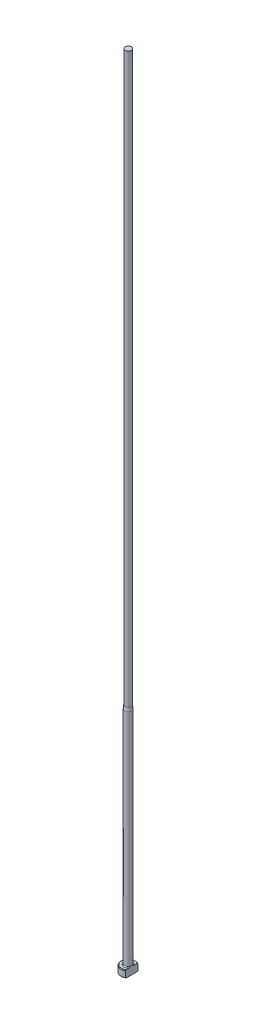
ISO-10303-21;
HEADER;
FILE_DESCRIPTION(('STEP AP214'),'2;1');
FILE_NAME('part.step','',(''),(''),'','','');
FILE_SCHEMA(('AUTOMOTIVE_DESIGN { 1 0 10303 214 1 1 1 1 }'));
ENDSEC;
DATA;
#1=APPLICATION_CONTEXT('core data for automotive mechanical design processes');
#2=APPLICATION_PROTOCOL_DEFINITION('international standard','automotive_design',2000,#1);
#3=PRODUCT_CONTEXT('',#1,'mechanical');
#4=PRODUCT('Part','Part','',(#3));
#5=PRODUCT_RELATED_PRODUCT_CATEGORY('part','',(#4));
#6=PRODUCT_DEFINITION_FORMATION('','',#4);
#7=PRODUCT_DEFINITION_CONTEXT('part definition',#1,'design');
#8=PRODUCT_DEFINITION('design','',#6,#7);
#9=PRODUCT_DEFINITION_SHAPE('','',#8);
#10=(LENGTH_UNIT() NAMED_UNIT(*) SI_UNIT(.MILLI.,.METRE.));
#11=(NAMED_UNIT(*) PLANE_ANGLE_UNIT() SI_UNIT($,.RADIAN.));
#12=(NAMED_UNIT(*) SI_UNIT($,.STERADIAN.) SOLID_ANGLE_UNIT());
#13=UNCERTAINTY_MEASURE_WITH_UNIT(LENGTH_MEASURE(1.E-05),#10,'distance_accuracy_value','');
#14=(GEOMETRIC_REPRESENTATION_CONTEXT(3) GLOBAL_UNCERTAINTY_ASSIGNED_CONTEXT((#13)) GLOBAL_UNIT_ASSIGNED_CONTEXT((#10,
#11,#12)) REPRESENTATION_CONTEXT('',''));
#15=CARTESIAN_POINT('',(0.,0.,0.));
#16=DIRECTION('',(0.,0.,1.));
#17=DIRECTION('',(1.,0.,0.));
#18=AXIS2_PLACEMENT_3D('',#15,#16,#17);
#19=CARTESIAN_POINT('',(-3.17499999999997,3.175,0.));
#20=DIRECTION('',(0.,1.,0.));
#21=DIRECTION('',(0.,0.,1.));
#22=AXIS2_PLACEMENT_3D('',#19,#20,#21);
#23=PLANE('',#22);
#24=CARTESIAN_POINT('',(0.,3.175,0.));
#25=DIRECTION('',(0.,1.,0.));
#26=DIRECTION('',(0.,0.,1.));
#27=AXIS2_PLACEMENT_3D('',#24,#25,#26);
#28=CIRCLE('',#27,2.92099999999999);
#29=CARTESIAN_POINT('',(1.58749999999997,3.175,-2.4519552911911));
#30=VERTEX_POINT('',#29);
#31=CARTESIAN_POINT('',(1.58749999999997,3.175,2.4519552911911));
#32=VERTEX_POINT('',#31);
#33=EDGE_CURVE('E105',#30,#32,#28,.T.);
#34=ORIENTED_EDGE('',*,*,#33,.T.);
#35=DIRECTION('',(0.,0.,1.));
#36=VECTOR('',#35,1.);
#37=CARTESIAN_POINT('',(1.58749999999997,3.17499999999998,2.74963065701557));
#38=LINE('',#37,#36);
#39=CARTESIAN_POINT('',(1.58749999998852,3.175,1.16397422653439));
#40=VERTEX_POINT('',#39);
#41=EDGE_CURVE('E126',#40,#32,#38,.T.);
#42=ORIENTED_EDGE('',*,*,#41,.F.);
#43=CARTESIAN_POINT('',(0.,3.175,0.));
#44=DIRECTION('',(0.,1.,0.));
#45=DIRECTION('',(0.,0.,1.));
#46=AXIS2_PLACEMENT_3D('',#43,#44,#45);
#47=CIRCLE('',#46,1.96849999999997);
#48=CARTESIAN_POINT('',(1.58749999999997,3.175,-1.16397422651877));
#49=VERTEX_POINT('',#48);
#50=EDGE_CURVE('E11',#40,#49,#47,.F.);
#51=ORIENTED_EDGE('',*,*,#50,.T.);
#52=EDGE_CURVE('E52',#30,#49,#38,.T.);
#53=ORIENTED_EDGE('',*,*,#52,.F.);
#54=EDGE_LOOP('',(#34,#42,#51,#53));
#55=FACE_BOUND('',#54,.T.);
#56=ADVANCED_FACE('F32',(#55),#23,.T.);
#57=CARTESIAN_POINT('',(0.,259.958771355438,0.));
#58=DIRECTION('',(0.,1.,0.));
#59=DIRECTION('',(0.,0.,1.));
#60=AXIS2_PLACEMENT_3D('',#57,#58,#59);
#61=CYLINDRICAL_SURFACE('',#60,3.17499999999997);
#62=CARTESIAN_POINT('',(0.,2.92100000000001,0.));
#63=DIRECTION('',(0.,1.,0.));
#64=DIRECTION('',(0.,0.,1.));
#65=AXIS2_PLACEMENT_3D('',#62,#63,#64);
#66=CIRCLE('',#65,3.17499999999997);
#67=CARTESIAN_POINT('',(1.58749999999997,2.92100000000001,2.74963065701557));
#68=VERTEX_POINT('',#67);
#69=CARTESIAN_POINT('',(1.58749999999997,2.92100000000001,-2.74963065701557));
#70=VERTEX_POINT('',#69);
#71=EDGE_CURVE('E98',#68,#70,#66,.F.);
#72=ORIENTED_EDGE('',*,*,#71,.T.);
#73=DIRECTION('',(0.,-1.,0.));
#74=VECTOR('',#73,1.);
#75=CARTESIAN_POINT('',(1.58749999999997,355.601,-2.74963065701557));
#76=LINE('',#75,#74);
#77=CARTESIAN_POINT('',(1.58749999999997,0.253999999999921,-2.74963065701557));
#78=VERTEX_POINT('',#77);
#79=EDGE_CURVE('E141',#70,#78,#76,.T.);
#80=ORIENTED_EDGE('',*,*,#79,.T.);
#81=CARTESIAN_POINT('',(0.,0.253999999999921,0.));
#82=DIRECTION('',(0.,-1.,0.));
#83=DIRECTION('',(0.,0.,-1.));
#84=AXIS2_PLACEMENT_3D('',#81,#82,#83);
#85=CIRCLE('',#84,3.17499999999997);
#86=CARTESIAN_POINT('',(1.58749999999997,0.253999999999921,2.74963065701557));
#87=VERTEX_POINT('',#86);
#88=EDGE_CURVE('E95',#78,#87,#85,.F.);
#89=ORIENTED_EDGE('',*,*,#88,.T.);
#90=DIRECTION('',(0.,-1.,0.));
#91=VECTOR('',#90,1.);
#92=CARTESIAN_POINT('',(1.58749999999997,355.601,2.74963065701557));
#93=LINE('',#92,#91);
#94=EDGE_CURVE('E88',#68,#87,#93,.T.);
#95=ORIENTED_EDGE('',*,*,#94,.F.);
#96=EDGE_LOOP('',(#72,#80,#89,#95));
#97=FACE_BOUND('',#96,.T.);
#98=ADVANCED_FACE('F191',(#97),#61,.T.);
#99=CARTESIAN_POINT('',(0.,0.,0.));
#100=DIRECTION('',(0.,-1.,0.));
#101=DIRECTION('',(0.,0.,-1.));
#102=AXIS2_PLACEMENT_3D('',#99,#100,#101);
#103=PLANE('',#102);
#104=CARTESIAN_POINT('',(0.,0.,0.));
#105=DIRECTION('',(0.,-1.,0.));
#106=DIRECTION('',(0.,0.,-1.));
#107=AXIS2_PLACEMENT_3D('',#104,#105,#106);
#108=CIRCLE('',#107,2.92100000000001);
#109=CARTESIAN_POINT('',(1.58749999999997,0.,2.45195529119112));
#110=VERTEX_POINT('',#109);
#111=CARTESIAN_POINT('',(1.58749999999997,0.,-2.45195529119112));
#112=VERTEX_POINT('',#111);
#113=EDGE_CURVE('E93',#110,#112,#108,.T.);
#114=ORIENTED_EDGE('',*,*,#113,.T.);
#115=DIRECTION('',(0.,0.,1.));
#116=VECTOR('',#115,1.);
#117=CARTESIAN_POINT('',(1.58749999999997,0.,2.74963065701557));
#118=LINE('',#117,#116);
#119=EDGE_CURVE('E78',#112,#110,#118,.T.);
#120=ORIENTED_EDGE('',*,*,#119,.T.);
#121=EDGE_LOOP('',(#114,#120));
#122=FACE_BOUND('',#121,.T.);
#123=ADVANCED_FACE('F97',(#122),#103,.T.);
#124=CARTESIAN_POINT('',(0.,3.17499999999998,0.));
#125=DIRECTION('',(0.,-1.,0.));
#126=DIRECTION('',(0.,0.,-1.));
#127=AXIS2_PLACEMENT_3D('',#124,#125,#126);
#128=CONICAL_SURFACE('',#127,2.92100000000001,0.785398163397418);
#129=ORIENTED_EDGE('',*,*,#71,.F.);
#130=CARTESIAN_POINT('',(1.58749999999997,-0.161620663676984,-6.0529050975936));
#131=CARTESIAN_POINT('',(1.58749999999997,-0.0288893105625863,-5.91567682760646));
#132=CARTESIAN_POINT('',(1.58749999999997,0.103699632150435,-5.77831035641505));
#133=CARTESIAN_POINT('',(1.58749999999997,0.368508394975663,-5.50321874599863));
#134=CARTESIAN_POINT('',(1.58749999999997,0.5007282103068,-5.3654936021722));
#135=CARTESIAN_POINT('',(1.58749999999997,0.764778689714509,-5.08953516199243));
#136=CARTESIAN_POINT('',(1.58749999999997,0.896609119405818,-4.95130164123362));
#137=CARTESIAN_POINT('',(1.58749999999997,1.15968706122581,-4.67428233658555));
#138=CARTESIAN_POINT('',(1.58749999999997,1.29093457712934,-4.5354965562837));
#139=CARTESIAN_POINT('',(1.58749999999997,1.55007705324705,-4.25997724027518));
#140=CARTESIAN_POINT('',(1.58749999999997,1.67798684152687,-4.12325766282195));
#141=CARTESIAN_POINT('',(1.58749999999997,1.9328486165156,-3.84892898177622));
#142=CARTESIAN_POINT('',(1.58749999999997,2.05980060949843,-3.71131988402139));
#143=CARTESIAN_POINT('',(1.58749999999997,2.31237508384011,-3.43493978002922));
#144=CARTESIAN_POINT('',(1.58749999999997,2.43799784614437,-3.29616903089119));
#145=CARTESIAN_POINT('',(1.58749999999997,2.68741369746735,-3.01699558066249));
#146=CARTESIAN_POINT('',(1.58749999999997,2.81120686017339,-2.8765929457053));
#147=CARTESIAN_POINT('',(1.58749999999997,3.00875865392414,-2.64816703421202));
#148=CARTESIAN_POINT('',(1.58749999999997,3.08336151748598,-2.56087478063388));
#149=CARTESIAN_POINT('',(1.58749999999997,3.23123871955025,-2.385154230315));
#150=CARTESIAN_POINT('',(1.58749999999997,3.30451292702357,-2.29672582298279));
#151=CARTESIAN_POINT('',(1.58749999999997,3.45004422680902,-2.11747400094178));
#152=CARTESIAN_POINT('',(1.58749999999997,3.52228237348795,-2.02663514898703));
#153=CARTESIAN_POINT('',(1.58749999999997,3.66423097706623,-1.84302524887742));
#154=CARTESIAN_POINT('',(1.58749999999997,3.73394203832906,-1.75025467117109));
#155=CARTESIAN_POINT('',(1.58749999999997,3.87080633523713,-1.56067475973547));
#156=CARTESIAN_POINT('',(1.58749999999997,3.93790459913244,-1.46382547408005));
#157=CARTESIAN_POINT('',(1.58749999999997,4.06669147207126,-1.26632594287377));
#158=CARTESIAN_POINT('',(1.58749999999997,4.12837264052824,-1.16567073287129));
#159=CARTESIAN_POINT('',(1.58749999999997,4.21402252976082,-1.01165766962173));
#160=CARTESIAN_POINT('',(1.58749999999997,4.2412792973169,-0.960142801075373));
#161=CARTESIAN_POINT('',(1.58749999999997,4.29309798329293,-0.85578092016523));
#162=CARTESIAN_POINT('',(1.58749999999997,4.3176594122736,-0.802933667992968));
#163=CARTESIAN_POINT('',(1.58749999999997,4.38614656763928,-0.642461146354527));
#164=CARTESIAN_POINT('',(1.58749999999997,4.42510149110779,-0.532518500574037));
#165=CARTESIAN_POINT('',(1.58749999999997,4.46726244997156,-0.367680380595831));
#166=CARTESIAN_POINT('',(1.58749999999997,4.47844427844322,-0.314802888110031));
#167=CARTESIAN_POINT('',(1.58749999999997,4.49576654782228,-0.208209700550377));
#168=CARTESIAN_POINT('',(1.58749999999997,4.50190743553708,-0.154494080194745));
#169=CARTESIAN_POINT('',(1.58749999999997,4.50871296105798,-0.0468792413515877));
#170=CARTESIAN_POINT('',(1.58749999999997,4.50939451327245,0.00701889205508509));
#171=CARTESIAN_POINT('',(1.58749999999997,4.5052767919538,0.114606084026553));
#172=CARTESIAN_POINT('',(1.58749999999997,4.5004770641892,0.16829512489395));
#173=CARTESIAN_POINT('',(1.58749999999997,4.48579689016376,0.274485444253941));
#174=CARTESIAN_POINT('',(1.58749999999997,4.47596081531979,0.326992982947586));
#175=CARTESIAN_POINT('',(1.58749999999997,4.4518180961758,0.430974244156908));
#176=CARTESIAN_POINT('',(1.58749999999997,4.43750969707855,0.482447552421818));
#177=CARTESIAN_POINT('',(1.58749999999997,4.40502489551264,0.58446088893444));
#178=CARTESIAN_POINT('',(1.58749999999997,4.38682724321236,0.634994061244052));
#179=CARTESIAN_POINT('',(1.58749999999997,4.34729308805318,0.734789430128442));
#180=CARTESIAN_POINT('',(1.58749999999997,4.32595722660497,0.784051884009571));
#181=CARTESIAN_POINT('',(1.58749999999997,4.25791922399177,0.93054934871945));
#182=CARTESIAN_POINT('',(1.58749999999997,4.20736047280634,1.02598802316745));
#183=CARTESIAN_POINT('',(1.58749999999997,4.09955451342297,1.21304313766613));
#184=CARTESIAN_POINT('',(1.58749999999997,4.04229912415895,1.30465471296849));
#185=CARTESIAN_POINT('',(1.58749999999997,3.92308746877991,1.48526211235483));
#186=CARTESIAN_POINT('',(1.58749999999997,3.86111349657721,1.57424615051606));
#187=CARTESIAN_POINT('',(1.58749999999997,3.73408621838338,1.74990003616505));
#188=CARTESIAN_POINT('',(1.58749999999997,3.66903444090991,1.83657099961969));
#189=CARTESIAN_POINT('',(1.58749999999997,3.53583371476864,2.009317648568));
#190=CARTESIAN_POINT('',(1.58749999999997,3.46765527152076,2.09537048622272));
#191=CARTESIAN_POINT('',(1.58749999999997,3.32960643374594,2.26611736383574));
#192=CARTESIAN_POINT('',(1.58749999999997,3.25973586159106,2.35081125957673));
#193=CARTESIAN_POINT('',(1.58749999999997,3.04858139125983,2.60290121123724));
#194=CARTESIAN_POINT('',(1.58749999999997,2.90542388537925,2.7687253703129));
#195=CARTESIAN_POINT('',(1.58749999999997,2.64069522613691,3.06970913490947));
#196=CARTESIAN_POINT('',(1.58749999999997,2.5195945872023,3.20528660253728));
#197=CARTESIAN_POINT('',(1.58749999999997,2.27590400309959,3.47510321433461));
#198=CARTESIAN_POINT('',(1.58749999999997,2.1533140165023,3.60934232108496));
#199=CARTESIAN_POINT('',(1.58749999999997,1.9069423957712,3.87695374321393));
#200=CARTESIAN_POINT('',(1.58749999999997,1.78315974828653,4.01032512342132));
#201=CARTESIAN_POINT('',(1.58749999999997,1.53478104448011,4.2763088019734));
#202=CARTESIAN_POINT('',(1.58749999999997,1.41018498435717,4.40892109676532));
#203=CARTESIAN_POINT('',(1.58749999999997,1.04574684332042,4.79499418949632));
#204=CARTESIAN_POINT('',(1.58749999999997,0.805076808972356,5.04767313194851));
#205=CARTESIAN_POINT('',(1.58749999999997,0.44312150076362,5.42550911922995));
#206=CARTESIAN_POINT('',(1.58749999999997,0.322378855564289,5.55118772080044));
#207=CARTESIAN_POINT('',(1.58749999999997,0.0805914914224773,5.8022520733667));
#208=CARTESIAN_POINT('',(1.58749999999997,-0.0404532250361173,5.92763782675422));
#209=CARTESIAN_POINT('',(1.58749999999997,-0.161620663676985,6.0529050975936));
#210=B_SPLINE_CURVE_WITH_KNOTS('',3,(#130,#131,#132,#133,#134,#135,#136,#137,#138,#139,#140,
#141,#142,#143,#144,#145,#146,#147,#148,#149,#150,#151,#152,#153,#154,#155,#156,#157,#158,#159,
#160,#161,#162,#163,#164,#165,#166,#167,#168,#169,#170,#171,#172,#173,#174,#175,#176,#177,#178,
#179,#180,#181,#182,#183,#184,#185,#186,#187,#188,#189,#190,#191,#192,#193,#194,#195,#196,#197,
#198,#199,#200,#201,#202,#203,#204,#205,#206,#207,#208,#209),.UNSPECIFIED.,.F.,.F.,(4,2,2,2,2,2,
2,2,2,2,2,2,2,2,2,2,2,2,2,2,2,2,2,2,2,2,2,2,2,2,2,2,2,2,2,2,2,2,2,4),(0.,0.572750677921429,
1.14550874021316,1.71856057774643,2.29160869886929,2.85328006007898,3.41494773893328,
3.97649423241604,4.53801804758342,4.88249307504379,5.2270018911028,5.57515326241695,
5.92322081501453,6.27657800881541,6.63041319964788,6.80518126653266,6.97998101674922,
7.32824262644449,7.49018491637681,7.65211285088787,7.81353889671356,7.97497832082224,
8.13501929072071,8.29512313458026,8.45612518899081,8.61709438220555,8.94062993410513,
9.26456495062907,9.58978187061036,9.91483894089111,10.2441741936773,10.5735441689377,
11.2306812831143,11.7760337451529,12.3214014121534,12.8672825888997,13.4131663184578,
14.4600164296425,14.9828595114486,15.505698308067),.UNSPECIFIED.);
#211=EDGE_CURVE('E118',#32,#68,#210,.T.);
#212=ORIENTED_EDGE('',*,*,#211,.F.);
#213=ORIENTED_EDGE('',*,*,#33,.F.);
#214=EDGE_CURVE('E117',#70,#30,#210,.T.);
#215=ORIENTED_EDGE('',*,*,#214,.F.);
#216=EDGE_LOOP('',(#129,#212,#213,#215));
#217=FACE_BOUND('',#216,.T.);
#218=ADVANCED_FACE('F162',(#217),#128,.T.);
#219=CARTESIAN_POINT('',(0.,0.253999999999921,0.));
#220=DIRECTION('',(0.,1.,0.));
#221=DIRECTION('',(0.,0.,1.));
#222=AXIS2_PLACEMENT_3D('',#219,#220,#221);
#223=CONICAL_SURFACE('',#222,3.17499999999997,0.785398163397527);
#224=ORIENTED_EDGE('',*,*,#88,.F.);
#225=CARTESIAN_POINT('',(1.58749999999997,3.33662066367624,6.0529050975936));
#226=CARTESIAN_POINT('',(1.58749999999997,3.20388931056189,5.91567682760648));
#227=CARTESIAN_POINT('',(1.58749999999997,3.07130036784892,5.7783103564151));
#228=CARTESIAN_POINT('',(1.58749999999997,2.80649160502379,5.50321874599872));
#229=CARTESIAN_POINT('',(1.58749999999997,2.6742717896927,5.36549360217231));
#230=CARTESIAN_POINT('',(1.58749999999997,2.41022131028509,5.08953516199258));
#231=CARTESIAN_POINT('',(1.58749999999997,2.27839088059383,4.95130164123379));
#232=CARTESIAN_POINT('',(1.58749999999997,2.01531293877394,4.67428233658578));
#233=CARTESIAN_POINT('',(1.58749999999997,1.88406542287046,4.53549655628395));
#234=CARTESIAN_POINT('',(1.58749999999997,1.62492294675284,4.25997724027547));
#235=CARTESIAN_POINT('',(1.58749999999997,1.49701315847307,4.12325766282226));
#236=CARTESIAN_POINT('',(1.58749999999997,1.24215138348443,3.84892898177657));
#237=CARTESIAN_POINT('',(1.58749999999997,1.11519939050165,3.71131988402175));
#238=CARTESIAN_POINT('',(1.58749999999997,0.862624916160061,3.43493978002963));
#239=CARTESIAN_POINT('',(1.58749999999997,0.737002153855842,3.29616903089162));
#240=CARTESIAN_POINT('',(1.58749999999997,0.487586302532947,3.01699558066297));
#241=CARTESIAN_POINT('',(1.58749999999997,0.363793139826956,2.8765929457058));
#242=CARTESIAN_POINT('',(1.58749999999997,0.166241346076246,2.64816703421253));
#243=CARTESIAN_POINT('',(1.58749999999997,0.0916384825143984,2.56087478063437));
#244=CARTESIAN_POINT('',(1.58749999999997,-0.0562387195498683,2.38515423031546));
#245=CARTESIAN_POINT('',(1.58749999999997,-0.129512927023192,2.29672582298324));
#246=CARTESIAN_POINT('',(1.58749999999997,-0.275044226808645,2.1174740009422));
#247=CARTESIAN_POINT('',(1.58749999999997,-0.347282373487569,2.02663514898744));
#248=CARTESIAN_POINT('',(1.58749999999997,-0.489230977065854,1.8430252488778));
#249=CARTESIAN_POINT('',(1.58749999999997,-0.558942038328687,1.75025467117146));
#250=CARTESIAN_POINT('',(1.58749999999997,-0.695806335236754,1.5606747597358));
#251=CARTESIAN_POINT('',(1.58749999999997,-0.762904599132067,1.46382547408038));
#252=CARTESIAN_POINT('',(1.58749999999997,-0.89169147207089,1.26632594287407));
#253=CARTESIAN_POINT('',(1.58749999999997,-0.953372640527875,1.16567073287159));
#254=CARTESIAN_POINT('',(1.58749999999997,-1.03902252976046,1.01165766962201));
#255=CARTESIAN_POINT('',(1.58749999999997,-1.06627929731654,0.960142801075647));
#256=CARTESIAN_POINT('',(1.58749999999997,-1.11809798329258,0.855780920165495));
#257=CARTESIAN_POINT('',(1.58749999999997,-1.14265941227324,0.802933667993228));
#258=CARTESIAN_POINT('',(1.58749999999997,-1.21114656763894,0.642461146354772));
#259=CARTESIAN_POINT('',(1.58749999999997,-1.25010149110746,0.532518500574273));
#260=CARTESIAN_POINT('',(1.58749999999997,-1.29226244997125,0.367680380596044));
#261=CARTESIAN_POINT('',(1.58749999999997,-1.30344427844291,0.314802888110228));
#262=CARTESIAN_POINT('',(1.58749999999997,-1.32076654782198,0.208209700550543));
#263=CARTESIAN_POINT('',(1.58749999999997,-1.32690743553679,0.154494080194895));
#264=CARTESIAN_POINT('',(1.58749999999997,-1.3337129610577,0.0468792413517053));
#265=CARTESIAN_POINT('',(1.58749999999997,-1.33439451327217,-0.00701889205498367));
#266=CARTESIAN_POINT('',(1.58749999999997,-1.33027679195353,-0.114606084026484));
#267=CARTESIAN_POINT('',(1.58749999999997,-1.32547706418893,-0.168295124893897));
#268=CARTESIAN_POINT('',(1.58749999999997,-1.31079689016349,-0.274485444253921));
#269=CARTESIAN_POINT('',(1.58749999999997,-1.30096081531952,-0.326992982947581));
#270=CARTESIAN_POINT('',(1.58749999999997,-1.27681809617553,-0.430974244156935));
#271=CARTESIAN_POINT('',(1.58749999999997,-1.26250969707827,-0.48244755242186));
#272=CARTESIAN_POINT('',(1.58749999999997,-1.23002489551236,-0.584460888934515));
#273=CARTESIAN_POINT('',(1.58749999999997,-1.21182724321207,-0.634994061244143));
#274=CARTESIAN_POINT('',(1.58749999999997,-1.17229308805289,-0.734789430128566));
#275=CARTESIAN_POINT('',(1.58749999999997,-1.15095722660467,-0.784051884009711));
#276=CARTESIAN_POINT('',(1.58749999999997,-1.08291922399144,-0.930549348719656));
#277=CARTESIAN_POINT('',(1.58749999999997,-1.03236047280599,-1.0259880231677));
#278=CARTESIAN_POINT('',(1.58749999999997,-0.924554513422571,-1.21304313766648));
#279=CARTESIAN_POINT('',(1.58749999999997,-0.867299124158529,-1.30465471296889));
#280=CARTESIAN_POINT('',(1.58749999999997,-0.748087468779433,-1.48526211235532));
#281=CARTESIAN_POINT('',(1.58749999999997,-0.686113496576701,-1.5742461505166));
#282=CARTESIAN_POINT('',(1.58749999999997,-0.559086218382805,-1.74990003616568));
#283=CARTESIAN_POINT('',(1.58749999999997,-0.494034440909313,-1.83657099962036));
#284=CARTESIAN_POINT('',(1.58749999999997,-0.360833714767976,-2.00931764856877));
#285=CARTESIAN_POINT('',(1.58749999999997,-0.292655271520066,-2.09537048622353));
#286=CARTESIAN_POINT('',(1.58749999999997,-0.154606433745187,-2.26611736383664));
#287=CARTESIAN_POINT('',(1.58749999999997,-0.0847358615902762,-2.35081125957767));
#288=CARTESIAN_POINT('',(1.58749999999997,0.126418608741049,-2.60290121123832));
#289=CARTESIAN_POINT('',(1.58749999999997,0.269576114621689,-2.76872537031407));
#290=CARTESIAN_POINT('',(1.58749999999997,0.534304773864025,-3.06970913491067));
#291=CARTESIAN_POINT('',(1.58749999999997,0.655405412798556,-3.20528660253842));
#292=CARTESIAN_POINT('',(1.58749999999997,0.899095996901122,-3.47510321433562));
#293=CARTESIAN_POINT('',(1.58749999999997,1.02168598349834,-3.60934232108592));
#294=CARTESIAN_POINT('',(1.58749999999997,1.26805760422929,-3.87695374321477));
#295=CARTESIAN_POINT('',(1.58749999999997,1.39184025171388,-4.0103251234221));
#296=CARTESIAN_POINT('',(1.58749999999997,1.64021895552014,-4.27630880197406));
#297=CARTESIAN_POINT('',(1.58749999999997,1.76481501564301,-4.40892109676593));
#298=CARTESIAN_POINT('',(1.58749999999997,2.12925315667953,-4.79499418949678));
#299=CARTESIAN_POINT('',(1.58749999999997,2.36992319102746,-5.04767313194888));
#300=CARTESIAN_POINT('',(1.58749999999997,2.73187849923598,-5.42550911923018));
#301=CARTESIAN_POINT('',(1.58749999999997,2.85262114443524,-5.55118772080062));
#302=CARTESIAN_POINT('',(1.58749999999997,3.09440850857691,-5.80225207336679));
#303=CARTESIAN_POINT('',(1.58749999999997,3.21545322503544,-5.92763782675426));
#304=CARTESIAN_POINT('',(1.58749999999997,3.33662066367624,-6.0529050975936));
#305=B_SPLINE_CURVE_WITH_KNOTS('',3,(#225,#226,#227,#228,#229,#230,#231,#232,#233,#234,#235,
#236,#237,#238,#239,#240,#241,#242,#243,#244,#245,#246,#247,#248,#249,#250,#251,#252,#253,#254,
#255,#256,#257,#258,#259,#260,#261,#262,#263,#264,#265,#266,#267,#268,#269,#270,#271,#272,#273,
#274,#275,#276,#277,#278,#279,#280,#281,#282,#283,#284,#285,#286,#287,#288,#289,#290,#291,#292,
#293,#294,#295,#296,#297,#298,#299,#300,#301,#302,#303,#304),.UNSPECIFIED.,.F.,.F.,(4,2,2,2,2,2,
2,2,2,2,2,2,2,2,2,2,2,2,2,2,2,2,2,2,2,2,2,2,2,2,2,2,2,2,2,2,2,2,2,4),(0.,0.572750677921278,
1.14550874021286,1.71856057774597,2.29160869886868,2.85328006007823,3.4149477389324,
3.97649423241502,4.53801804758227,4.88249307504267,5.22700189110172,5.5751532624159,
5.92322081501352,6.27657800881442,6.63041319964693,6.80518126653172,6.9799810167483,
7.3282426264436,7.49018491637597,7.65211285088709,7.81353889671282,7.97497832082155,
8.13501929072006,8.29512313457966,8.45612518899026,8.61709438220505,8.9406299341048,
9.2645649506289,9.58978187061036,9.91483894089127,10.2441741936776,10.5735441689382,
11.2306812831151,11.7760337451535,12.3214014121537,12.8672825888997,13.4131663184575,
14.4600164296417,14.9828595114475,15.5056983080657),.UNSPECIFIED.);
#306=EDGE_CURVE('E81',#112,#78,#305,.T.);
#307=ORIENTED_EDGE('',*,*,#306,.F.);
#308=ORIENTED_EDGE('',*,*,#113,.F.);
#309=EDGE_CURVE('E84',#87,#110,#305,.T.);
#310=ORIENTED_EDGE('',*,*,#309,.F.);
#311=EDGE_LOOP('',(#224,#307,#308,#310));
#312=FACE_BOUND('',#311,.T.);
#313=ADVANCED_FACE('F92',(#312),#223,.T.);
#314=CARTESIAN_POINT('',(0.,3.556,0.));
#315=DIRECTION('',(0.,1.,0.));
#316=DIRECTION('',(0.,0.,1.));
#317=AXIS2_PLACEMENT_3D('',#314,#315,#316);
#318=TOROIDAL_SURFACE('',#317,1.96849999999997,0.381);
#319=CARTESIAN_POINT('',(1.58749999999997,3.556,0.));
#320=CARTESIAN_POINT('',(1.58749999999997,3.55599928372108,-9.72839998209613E-12));
#321=CARTESIAN_POINT('',(1.58749999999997,3.55599856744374,-1.16390048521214E-07));
#322=CARTESIAN_POINT('',(1.58749999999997,3.55599717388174,-5.02802253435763E-07));
#323=CARTESIAN_POINT('',(1.58749999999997,3.55599649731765,-7.75049116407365E-07));
#324=CARTESIAN_POINT('',(1.58749999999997,3.55599515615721,-1.43578185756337E-06));
#325=CARTESIAN_POINT('',(1.58749999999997,3.55599449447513,-1.83004116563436E-06));
#326=CARTESIAN_POINT('',(1.58749999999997,3.55599322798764,-2.69326525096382E-06));
#327=CARTESIAN_POINT('',(1.58749999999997,3.55599262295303,-3.16190628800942E-06));
#328=CARTESIAN_POINT('',(1.58749999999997,3.55599066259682,-4.80183833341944E-06));
#329=CARTESIAN_POINT('',(1.58749999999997,3.55598938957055,-6.07237548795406E-06));
#330=CARTESIAN_POINT('',(1.58749999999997,3.55598706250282,-8.74131694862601E-06));
#331=CARTESIAN_POINT('',(1.58749999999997,3.55598600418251,-1.01362054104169E-05));
#332=CARTESIAN_POINT('',(1.58749999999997,3.55598220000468,-1.54025644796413E-05));
#333=CARTESIAN_POINT('',(1.58749999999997,3.55597966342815,-1.94297992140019E-05));
#334=CARTESIAN_POINT('',(1.58749999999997,3.55597535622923,-2.75116574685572E-05));
#335=CARTESIAN_POINT('',(1.58749999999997,3.55597354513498,-3.15456374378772E-05));
#336=CARTESIAN_POINT('',(1.58749999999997,3.55596616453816,-4.82039076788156E-05));
#337=CARTESIAN_POINT('',(1.58749999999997,3.55596077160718,-6.08993138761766E-05));
#338=CARTESIAN_POINT('',(1.58749999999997,3.55595181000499,-8.49758225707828E-05));
#339=CARTESIAN_POINT('',(1.58749999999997,3.55594809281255,-9.6299831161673E-05));
#340=CARTESIAN_POINT('',(1.58749999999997,3.55591954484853,-0.000176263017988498));
#341=CARTESIAN_POINT('',(1.58749999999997,3.55588430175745,-0.000240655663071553));
#342=CARTESIAN_POINT('',(1.58749999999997,3.55575419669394,-0.000487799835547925));
#343=CARTESIAN_POINT('',(1.58749999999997,3.55566706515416,-0.000673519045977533));
#344=CARTESIAN_POINT('',(1.58749999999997,3.55532896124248,-0.00138308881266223));
#345=CARTESIAN_POINT('',(1.58749999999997,3.55506990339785,-0.0019038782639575));
#346=CARTESIAN_POINT('',(1.58749999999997,3.55403272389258,-0.00399959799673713));
#347=CARTESIAN_POINT('',(1.58749999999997,3.55326363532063,-0.0055779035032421));
#348=CARTESIAN_POINT('',(1.58749999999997,3.53734419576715,-0.0382341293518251));
#349=CARTESIAN_POINT('',(1.58749999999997,3.52209124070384,-0.0692744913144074));
#350=CARTESIAN_POINT('',(1.58749999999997,3.49234031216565,-0.130397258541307));
#351=CARTESIAN_POINT('',(1.58749999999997,3.4778343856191,-0.160476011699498));
#352=CARTESIAN_POINT('',(1.58749999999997,3.44756579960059,-0.22405302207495));
#353=CARTESIAN_POINT('',(1.58749999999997,3.43183768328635,-0.257567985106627));
#354=CARTESIAN_POINT('',(1.58749999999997,3.40084315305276,-0.325196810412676));
#355=CARTESIAN_POINT('',(1.58749999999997,3.38558252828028,-0.359313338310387));
#356=CARTESIAN_POINT('',(1.58749999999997,3.35947844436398,-0.419670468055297));
#357=CARTESIAN_POINT('',(1.58749999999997,3.34845502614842,-0.445832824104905));
#358=CARTESIAN_POINT('',(1.58749999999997,3.32703860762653,-0.498343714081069));
#359=CARTESIAN_POINT('',(1.58749999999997,3.31664422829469,-0.52469168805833));
#360=CARTESIAN_POINT('',(1.58749999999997,3.2869407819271,-0.603098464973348));
#361=CARTESIAN_POINT('',(1.58749999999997,3.26865317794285,-0.655557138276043));
#362=CARTESIAN_POINT('',(1.58749999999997,3.24332469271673,-0.737608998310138));
#363=CARTESIAN_POINT('',(1.58749999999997,3.23494346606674,-0.766787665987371));
#364=CARTESIAN_POINT('',(1.58749999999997,3.21949479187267,-0.825628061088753));
#365=CARTESIAN_POINT('',(1.58749999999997,3.21243348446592,-0.855291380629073));
#366=CARTESIAN_POINT('',(1.58749999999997,3.19303275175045,-0.947623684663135));
#367=CARTESIAN_POINT('',(1.58749999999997,3.18336484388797,-1.01091582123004));
#368=CARTESIAN_POINT('',(1.58749999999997,3.17464826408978,-1.12491727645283));
#369=CARTESIAN_POINT('',(1.58749999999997,3.17379742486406,-1.17548103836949));
#370=CARTESIAN_POINT('',(1.58749999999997,3.17980825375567,-1.2756075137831));
#371=CARTESIAN_POINT('',(1.58749999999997,3.18656467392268,-1.32517446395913));
#372=CARTESIAN_POINT('',(1.58749999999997,3.20510062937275,-1.40268723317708));
#373=CARTESIAN_POINT('',(1.58749999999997,3.21379930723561,-1.43136704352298));
#374=CARTESIAN_POINT('',(1.58749999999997,3.23523847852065,-1.48727388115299));
#375=CARTESIAN_POINT('',(1.58749999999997,3.24798385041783,-1.51449910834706));
#376=CARTESIAN_POINT('',(1.58749999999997,3.27479889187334,-1.56082978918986));
#377=CARTESIAN_POINT('',(1.58749999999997,3.2880084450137,-1.5804296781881));
#378=CARTESIAN_POINT('',(1.58749999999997,3.31738741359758,-1.61726850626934));
#379=CARTESIAN_POINT('',(1.58749999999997,3.33355126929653,-1.63451177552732));
#380=CARTESIAN_POINT('',(1.58749999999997,3.3650209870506,-1.66235366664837));
#381=CARTESIAN_POINT('',(1.58749999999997,3.37976591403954,-1.67358404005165));
#382=CARTESIAN_POINT('',(1.58749999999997,3.41090649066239,-1.69348690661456));
#383=CARTESIAN_POINT('',(1.58749999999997,3.42730148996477,-1.70216040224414));
#384=CARTESIAN_POINT('',(1.58749999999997,3.46152587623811,-1.71647536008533));
#385=CARTESIAN_POINT('',(1.58749999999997,3.47936500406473,-1.72209384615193));
#386=CARTESIAN_POINT('',(1.58749999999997,3.51579449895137,-1.72977101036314));
#387=CARTESIAN_POINT('',(1.58749999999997,3.53438431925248,-1.73183223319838));
#388=CARTESIAN_POINT('',(1.58749999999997,3.5693049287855,-1.73220894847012));
#389=CARTESIAN_POINT('',(1.58749999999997,3.58563247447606,-1.73095378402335));
#390=CARTESIAN_POINT('',(1.58749999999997,3.61782719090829,-1.72566824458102));
#391=CARTESIAN_POINT('',(1.58749999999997,3.6336944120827,-1.72163817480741));
#392=CARTESIAN_POINT('',(1.58749999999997,3.66430913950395,-1.71112762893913));
#393=CARTESIAN_POINT('',(1.58749999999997,3.67907021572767,-1.70468621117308));
#394=CARTESIAN_POINT('',(1.58749999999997,3.7074589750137,-1.68967506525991));
#395=CARTESIAN_POINT('',(1.58749999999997,3.72108625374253,-1.68110458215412));
#396=CARTESIAN_POINT('',(1.58749999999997,3.75190835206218,-1.6586320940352));
#397=CARTESIAN_POINT('',(1.58749999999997,3.76852524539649,-1.64393589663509));
#398=CARTESIAN_POINT('',(1.58749999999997,3.79915076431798,-1.61203006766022));
#399=CARTESIAN_POINT('',(1.58749999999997,3.81315342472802,-1.59481484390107));
#400=CARTESIAN_POINT('',(1.58749999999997,3.84335302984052,-1.55180967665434));
#401=CARTESIAN_POINT('',(1.58749999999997,3.85840997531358,-1.52522183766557));
#402=CARTESIAN_POINT('',(1.58749999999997,3.8840928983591,-1.47008223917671));
#403=CARTESIAN_POINT('',(1.58749999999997,3.89472145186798,-1.44153163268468));
#404=CARTESIAN_POINT('',(1.58749999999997,3.91656912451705,-1.36850699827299));
#405=CARTESIAN_POINT('',(1.58749999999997,3.92534811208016,-1.32330828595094));
#406=CARTESIAN_POINT('',(1.58749999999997,3.93598980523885,-1.23163561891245));
#407=CARTESIAN_POINT('',(1.58749999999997,3.93776012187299,-1.18515271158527));
#408=CARTESIAN_POINT('',(1.58749999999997,3.93485724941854,-1.056626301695));
#409=CARTESIAN_POINT('',(1.58749999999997,3.9241811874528,-0.974728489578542));
#410=CARTESIAN_POINT('',(1.58749999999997,3.899893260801,-0.855941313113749));
#411=CARTESIAN_POINT('',(1.58749999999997,3.89075037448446,-0.817952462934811));
#412=CARTESIAN_POINT('',(1.58749999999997,3.87034922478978,-0.742758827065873));
#413=CARTESIAN_POINT('',(1.58749999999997,3.85910312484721,-0.705550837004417));
#414=CARTESIAN_POINT('',(1.58749999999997,3.83067738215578,-0.618900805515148));
#415=CARTESIAN_POINT('',(1.58749999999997,3.81279292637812,-0.56969368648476));
#416=CARTESIAN_POINT('',(1.58749999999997,3.78404415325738,-0.496059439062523));
#417=CARTESIAN_POINT('',(1.58749999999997,3.77402894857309,-0.471293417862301));
#418=CARTESIAN_POINT('',(1.58749999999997,3.75347166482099,-0.421913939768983));
#419=CARTESIAN_POINT('',(1.58749999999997,3.74292842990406,-0.39730096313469));
#420=CARTESIAN_POINT('',(1.58749999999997,3.71797467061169,-0.340371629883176));
#421=CARTESIAN_POINT('',(1.58749999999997,3.7034106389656,-0.308122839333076));
#422=CARTESIAN_POINT('',(1.58749999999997,3.67389634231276,-0.244169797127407));
#423=CARTESIAN_POINT('',(1.58749999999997,3.65895097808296,-0.212463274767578));
#424=CARTESIAN_POINT('',(1.58749999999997,3.63022587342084,-0.152300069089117));
#425=CARTESIAN_POINT('',(1.58749999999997,3.61647532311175,-0.123829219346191));
#426=CARTESIAN_POINT('',(1.58749999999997,3.58829058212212,-0.065967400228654));
#427=CARTESIAN_POINT('',(1.58749999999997,3.57384944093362,-0.036579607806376));
#428=CARTESIAN_POINT('',(1.58749999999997,3.55873641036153,-0.00557801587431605));
#429=CARTESIAN_POINT('',(1.58749999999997,3.557967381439,-0.00399981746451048));
#430=CARTESIAN_POINT('',(1.58749999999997,3.55693021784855,-0.00190412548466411));
#431=CARTESIAN_POINT('',(1.58749999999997,3.55667111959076,-0.00138325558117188));
#432=CARTESIAN_POINT('',(1.58749999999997,3.55633296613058,-0.00067358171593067));
#433=CARTESIAN_POINT('',(1.58749999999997,3.55624582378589,-0.000487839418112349));
#434=CARTESIAN_POINT('',(1.58749999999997,3.55611570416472,-0.000240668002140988));
#435=CARTESIAN_POINT('',(1.58749999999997,3.55608045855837,-0.000176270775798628));
#436=CARTESIAN_POINT('',(1.58749999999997,3.55605190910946,-9.63021903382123E-05));
#437=CARTESIAN_POINT('',(1.58749999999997,3.55604819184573,-8.49777827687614E-05));
#438=CARTESIAN_POINT('',(1.58749999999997,3.55603922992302,-6.09004217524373E-05));
#439=CARTESIAN_POINT('',(1.58749999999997,3.55603383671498,-4.82045726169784E-05));
#440=CARTESIAN_POINT('',(1.58749999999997,3.55602645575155,-3.15458034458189E-05));
#441=CARTESIAN_POINT('',(1.58749999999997,3.55602464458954,-2.75117552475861E-05));
#442=CARTESIAN_POINT('',(1.58749999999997,3.55602033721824,-1.94297725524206E-05));
#443=CARTESIAN_POINT('',(1.58749999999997,3.55601780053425,-1.54024835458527E-05));
#444=CARTESIAN_POINT('',(1.58749999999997,3.55601399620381,-1.01360754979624E-05));
#445=CARTESIAN_POINT('',(1.58749999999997,3.55601293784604,-8.7411813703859E-06));
#446=CARTESIAN_POINT('',(1.58749999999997,3.55601061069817,-6.07223627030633E-06));
#447=CARTESIAN_POINT('',(1.58749999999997,3.55600933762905,-4.80170138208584E-06));
#448=CARTESIAN_POINT('',(1.58749999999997,3.55600737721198,-3.16178168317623E-06));
#449=CARTESIAN_POINT('',(1.58749999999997,3.55600677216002,-2.69314602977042E-06));
#450=CARTESIAN_POINT('',(1.58749999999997,3.55600550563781,-1.82993577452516E-06));
#451=CARTESIAN_POINT('',(1.58749999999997,3.55600484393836,-1.43568493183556E-06));
#452=CARTESIAN_POINT('',(1.58749999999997,3.55600350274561,-7.74972790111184E-07));
#453=CARTESIAN_POINT('',(1.58749999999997,3.55600282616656,-5.02737772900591E-07));
#454=CARTESIAN_POINT('',(1.58749999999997,3.55600143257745,-1.16354060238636E-07));
#455=CARTESIAN_POINT('',(1.58749999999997,3.55600071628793,9.72852226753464E-12));
#456=CARTESIAN_POINT('',(1.58749999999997,3.556,0.));
#457=B_SPLINE_CURVE_WITH_KNOTS('',3,(#319,#320,#321,#322,#323,#324,#325,#326,#327,#328,#329,
#330,#331,#332,#333,#334,#335,#336,#337,#338,#339,#340,#341,#342,#343,#344,#345,#346,#347,#348,
#349,#350,#351,#352,#353,#354,#355,#356,#357,#358,#359,#360,#361,#362,#363,#364,#365,#366,#367,
#368,#369,#370,#371,#372,#373,#374,#375,#376,#377,#378,#379,#380,#381,#382,#383,#384,#385,#386,
#387,#388,#389,#390,#391,#392,#393,#394,#395,#396,#397,#398,#399,#400,#401,#402,#403,#404,#405,
#406,#407,#408,#409,#410,#411,#412,#413,#414,#415,#416,#417,#418,#419,#420,#421,#422,#423,#424,
#425,#426,#427,#428,#429,#430,#431,#432,#433,#434,#435,#436,#437,#438,#439,#440,#441,#442,#443,
#444,#445,#446,#447,#448,#449,#450,#451,#452,#453,#454,#455,#456),.UNSPECIFIED.,.T.,.F.,(4,2,2,
2,2,2,2,2,2,2,2,2,2,2,2,2,2,2,2,2,2,2,2,2,2,2,2,2,2,2,2,2,2,2,2,2,2,2,2,2,2,2,2,2,2,2,2,2,2,2,2,
2,2,2,2,2,2,2,2,2,2,2,2,2,2,2,2,2,4),(0.,2.14653634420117E-06,4.3243617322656E-06,
6.62715069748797E-06,8.92017875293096E-06,1.42892293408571E-05,1.95376032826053E-05,
3.37616071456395E-05,4.70144492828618E-05,8.83789092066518E-05,0.000124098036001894,
0.000343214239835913,0.000959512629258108,0.00270343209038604,0.00797166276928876,
0.11171345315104,0.21189766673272,0.322958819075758,0.435072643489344,0.520234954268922,
0.605203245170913,0.771741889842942,0.862787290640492,0.954246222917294,1.14571222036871,
1.29701464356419,1.44624921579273,1.53592478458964,1.62570887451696,1.69637166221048,
1.76690281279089,1.82229027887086,1.87765600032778,1.93343255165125,1.98916918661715,
2.03805361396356,2.08693266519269,2.13505202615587,2.18318847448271,2.24937187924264,
2.31570450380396,2.4068617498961,2.49796589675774,2.63532677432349,2.77449244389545,
3.02069049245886,3.13789423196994,3.25444001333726,3.41142684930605,3.491566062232,
3.57188909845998,3.67803747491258,3.78319074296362,3.87804579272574,3.97626481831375,
3.98153268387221,3.98327687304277,3.98389324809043,3.98411237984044,3.98414810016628,
3.98418946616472,3.98420271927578,3.98421694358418,3.98422219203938,3.9842275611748,
3.98422985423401,3.98423215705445,3.98423433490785,3.98423648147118),.UNSPECIFIED.);
#458=CARTESIAN_POINT('',(1.58749999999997,3.556,0.));
#459=VERTEX_POINT('',#458);
#460=EDGE_CURVE('E47',#459,#49,#457,.T.);
#461=ORIENTED_EDGE('',*,*,#460,.T.);
#462=ORIENTED_EDGE('',*,*,#50,.F.);
#463=CARTESIAN_POINT('',(1.58749999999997,3.556,0.));
#464=CARTESIAN_POINT('',(1.58749999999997,3.55600071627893,9.72842792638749E-12));
#465=CARTESIAN_POINT('',(1.58749999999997,3.55600143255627,1.16390048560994E-07));
#466=CARTESIAN_POINT('',(1.58749999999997,3.55600282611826,5.02802253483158E-07));
#467=CARTESIAN_POINT('',(1.58749999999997,3.55600350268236,7.7504911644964E-07));
#468=CARTESIAN_POINT('',(1.58749999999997,3.5560048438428,1.43578185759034E-06));
#469=CARTESIAN_POINT('',(1.58749999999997,3.55600550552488,1.83004116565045E-06));
#470=CARTESIAN_POINT('',(1.58749999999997,3.55600677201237,2.69326525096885E-06));
#471=CARTESIAN_POINT('',(1.58749999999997,3.55600737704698,3.16190628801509E-06));
#472=CARTESIAN_POINT('',(1.58749999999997,3.55600933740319,4.80183833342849E-06));
#473=CARTESIAN_POINT('',(1.58749999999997,3.55601061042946,6.07237548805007E-06));
#474=CARTESIAN_POINT('',(1.58749999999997,3.55601293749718,8.74131694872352E-06));
#475=CARTESIAN_POINT('',(1.58749999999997,3.55601399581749,1.01362054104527E-05));
#476=CARTESIAN_POINT('',(1.58749999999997,3.55601779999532,1.54025644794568E-05));
#477=CARTESIAN_POINT('',(1.58749999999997,3.55602033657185,1.94297992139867E-05));
#478=CARTESIAN_POINT('',(1.58749999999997,3.55602464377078,2.75116574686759E-05));
#479=CARTESIAN_POINT('',(1.58749999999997,3.55602645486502,3.15456374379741E-05));
#480=CARTESIAN_POINT('',(1.58749999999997,3.55603383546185,4.8203907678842E-05));
#481=CARTESIAN_POINT('',(1.58749999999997,3.55603922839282,6.0899313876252E-05));
#482=CARTESIAN_POINT('',(1.58749999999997,3.55604818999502,8.49758225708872E-05));
#483=CARTESIAN_POINT('',(1.58749999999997,3.55605190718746,9.62998311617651E-05));
#484=CARTESIAN_POINT('',(1.58749999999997,3.55608045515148,0.000176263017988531));
#485=CARTESIAN_POINT('',(1.58749999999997,3.55611569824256,0.000240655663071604));
#486=CARTESIAN_POINT('',(1.58749999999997,3.55624580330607,0.000487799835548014));
#487=CARTESIAN_POINT('',(1.58749999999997,3.55633293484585,0.000673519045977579));
#488=CARTESIAN_POINT('',(1.58749999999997,3.55667103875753,0.00138308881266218));
#489=CARTESIAN_POINT('',(1.58749999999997,3.55693009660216,0.00190387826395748));
#490=CARTESIAN_POINT('',(1.58749999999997,3.55796727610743,0.00399959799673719));
#491=CARTESIAN_POINT('',(1.58749999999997,3.55873636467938,0.00557790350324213));
#492=CARTESIAN_POINT('',(1.58749999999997,3.57465580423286,0.038234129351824));
#493=CARTESIAN_POINT('',(1.58749999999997,3.58990875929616,0.0692744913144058));
#494=CARTESIAN_POINT('',(1.58749999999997,3.61965968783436,0.130397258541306));
#495=CARTESIAN_POINT('',(1.58749999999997,3.63416561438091,0.160476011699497));
#496=CARTESIAN_POINT('',(1.58749999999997,3.66443420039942,0.22405302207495));
#497=CARTESIAN_POINT('',(1.58749999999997,3.68016231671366,0.257567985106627));
#498=CARTESIAN_POINT('',(1.58749999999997,3.71115684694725,0.325196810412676));
#499=CARTESIAN_POINT('',(1.58749999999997,3.72641747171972,0.359313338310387));
#500=CARTESIAN_POINT('',(1.58749999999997,3.75252155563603,0.419670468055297));
#501=CARTESIAN_POINT('',(1.58749999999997,3.76354497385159,0.445832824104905));
#502=CARTESIAN_POINT('',(1.58749999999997,3.78496139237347,0.498343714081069));
#503=CARTESIAN_POINT('',(1.58749999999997,3.79535577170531,0.524691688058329));
#504=CARTESIAN_POINT('',(1.58749999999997,3.82505921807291,0.603098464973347));
#505=CARTESIAN_POINT('',(1.58749999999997,3.84334682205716,0.655557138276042));
#506=CARTESIAN_POINT('',(1.58749999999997,3.86867530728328,0.737608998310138));
#507=CARTESIAN_POINT('',(1.58749999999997,3.87705653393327,0.766787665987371));
#508=CARTESIAN_POINT('',(1.58749999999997,3.89250520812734,0.825628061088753));
#509=CARTESIAN_POINT('',(1.58749999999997,3.89956651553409,0.855291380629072));
#510=CARTESIAN_POINT('',(1.58749999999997,3.91896724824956,0.947623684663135));
#511=CARTESIAN_POINT('',(1.58749999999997,3.92863515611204,1.01091582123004));
#512=CARTESIAN_POINT('',(1.58749999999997,3.93735173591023,1.12491727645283));
#513=CARTESIAN_POINT('',(1.58749999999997,3.93820257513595,1.17548103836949));
#514=CARTESIAN_POINT('',(1.58749999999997,3.93219174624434,1.2756075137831));
#515=CARTESIAN_POINT('',(1.58749999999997,3.92543532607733,1.32517446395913));
#516=CARTESIAN_POINT('',(1.58749999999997,3.90689937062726,1.40268723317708));
#517=CARTESIAN_POINT('',(1.58749999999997,3.8982006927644,1.43136704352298));
#518=CARTESIAN_POINT('',(1.58749999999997,3.87676152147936,1.48727388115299));
#519=CARTESIAN_POINT('',(1.58749999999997,3.86401614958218,1.51449910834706));
#520=CARTESIAN_POINT('',(1.58749999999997,3.83720110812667,1.56082978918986));
#521=CARTESIAN_POINT('',(1.58749999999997,3.82399155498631,1.5804296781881));
#522=CARTESIAN_POINT('',(1.58749999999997,3.79461258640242,1.61726850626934));
#523=CARTESIAN_POINT('',(1.58749999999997,3.77844873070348,1.63451177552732));
#524=CARTESIAN_POINT('',(1.58749999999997,3.74697901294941,1.66235366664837));
#525=CARTESIAN_POINT('',(1.58749999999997,3.73223408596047,1.67358404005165));
#526=CARTESIAN_POINT('',(1.58749999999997,3.70109350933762,1.69348690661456));
#527=CARTESIAN_POINT('',(1.58749999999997,3.68469851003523,1.70216040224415));
#528=CARTESIAN_POINT('',(1.58749999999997,3.65047412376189,1.71647536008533));
#529=CARTESIAN_POINT('',(1.58749999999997,3.63263499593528,1.72209384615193));
#530=CARTESIAN_POINT('',(1.58749999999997,3.59620550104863,1.72977101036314));
#531=CARTESIAN_POINT('',(1.58749999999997,3.57761568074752,1.73183223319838));
#532=CARTESIAN_POINT('',(1.58749999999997,3.54269507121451,1.73220894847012));
#533=CARTESIAN_POINT('',(1.58749999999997,3.52636752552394,1.73095378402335));
#534=CARTESIAN_POINT('',(1.58749999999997,3.49417280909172,1.72566824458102));
#535=CARTESIAN_POINT('',(1.58749999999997,3.47830558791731,1.72163817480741));
#536=CARTESIAN_POINT('',(1.58749999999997,3.44769086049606,1.71112762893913));
#537=CARTESIAN_POINT('',(1.58749999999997,3.43292978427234,1.70468621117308));
#538=CARTESIAN_POINT('',(1.58749999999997,3.40454102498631,1.68967506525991));
#539=CARTESIAN_POINT('',(1.58749999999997,3.39091374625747,1.68110458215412));
#540=CARTESIAN_POINT('',(1.58749999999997,3.36009164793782,1.6586320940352));
#541=CARTESIAN_POINT('',(1.58749999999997,3.34347475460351,1.64393589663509));
#542=CARTESIAN_POINT('',(1.58749999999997,3.31284923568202,1.61203006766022));
#543=CARTESIAN_POINT('',(1.58749999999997,3.29884657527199,1.59481484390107));
#544=CARTESIAN_POINT('',(1.58749999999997,3.26864697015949,1.55180967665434));
#545=CARTESIAN_POINT('',(1.58749999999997,3.25359002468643,1.52522183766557));
#546=CARTESIAN_POINT('',(1.58749999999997,3.22790710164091,1.47008223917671));
#547=CARTESIAN_POINT('',(1.58749999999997,3.21727854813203,1.44153163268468));
#548=CARTESIAN_POINT('',(1.58749999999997,3.19543087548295,1.36850699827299));
#549=CARTESIAN_POINT('',(1.58749999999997,3.18665188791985,1.32330828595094));
#550=CARTESIAN_POINT('',(1.58749999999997,3.17601019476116,1.23163561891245));
#551=CARTESIAN_POINT('',(1.58749999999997,3.17423987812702,1.18515271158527));
#552=CARTESIAN_POINT('',(1.58749999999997,3.17714275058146,1.05662630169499));
#553=CARTESIAN_POINT('',(1.58749999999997,3.18781881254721,0.974728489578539));
#554=CARTESIAN_POINT('',(1.58749999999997,3.21210673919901,0.855941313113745));
#555=CARTESIAN_POINT('',(1.58749999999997,3.22124962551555,0.817952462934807));
#556=CARTESIAN_POINT('',(1.58749999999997,3.24165077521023,0.742758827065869));
#557=CARTESIAN_POINT('',(1.58749999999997,3.25289687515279,0.705550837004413));
#558=CARTESIAN_POINT('',(1.58749999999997,3.28132261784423,0.618900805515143));
#559=CARTESIAN_POINT('',(1.58749999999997,3.29920707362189,0.569693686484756));
#560=CARTESIAN_POINT('',(1.58749999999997,3.32795584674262,0.496059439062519));
#561=CARTESIAN_POINT('',(1.58749999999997,3.33797105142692,0.471293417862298));
#562=CARTESIAN_POINT('',(1.58749999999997,3.35852833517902,0.42191393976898));
#563=CARTESIAN_POINT('',(1.58749999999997,3.36907157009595,0.397300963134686));
#564=CARTESIAN_POINT('',(1.58749999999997,3.39402532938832,0.340371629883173));
#565=CARTESIAN_POINT('',(1.58749999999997,3.40858936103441,0.308122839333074));
#566=CARTESIAN_POINT('',(1.58749999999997,3.43810365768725,0.244169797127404));
#567=CARTESIAN_POINT('',(1.58749999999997,3.45304902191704,0.212463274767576));
#568=CARTESIAN_POINT('',(1.58749999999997,3.48177412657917,0.152300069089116));
#569=CARTESIAN_POINT('',(1.58749999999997,3.49552467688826,0.123829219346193));
#570=CARTESIAN_POINT('',(1.58749999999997,3.52370941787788,0.0659674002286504));
#571=CARTESIAN_POINT('',(1.58749999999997,3.53815055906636,0.0365796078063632));
#572=CARTESIAN_POINT('',(1.58749999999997,3.55326358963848,0.00557801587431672));
#573=CARTESIAN_POINT('',(1.58749999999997,3.55403261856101,0.00399981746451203));
#574=CARTESIAN_POINT('',(1.58749999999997,3.55506978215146,0.00190412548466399));
#575=CARTESIAN_POINT('',(1.58749999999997,3.55532888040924,0.00138325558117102));
#576=CARTESIAN_POINT('',(1.58749999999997,3.55566703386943,0.00067358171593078));
#577=CARTESIAN_POINT('',(1.58749999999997,3.55575417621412,0.000487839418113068));
#578=CARTESIAN_POINT('',(1.58749999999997,3.55588429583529,0.000240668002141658));
#579=CARTESIAN_POINT('',(1.58749999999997,3.55591954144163,0.000176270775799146));
#580=CARTESIAN_POINT('',(1.58749999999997,3.55594809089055,9.63021903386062E-05));
#581=CARTESIAN_POINT('',(1.58749999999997,3.55595180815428,8.49777827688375E-05));
#582=CARTESIAN_POINT('',(1.58749999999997,3.55596077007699,6.09004217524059E-05));
#583=CARTESIAN_POINT('',(1.58749999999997,3.55596616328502,4.82045726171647E-05));
#584=CARTESIAN_POINT('',(1.58749999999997,3.55597354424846,3.15458034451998E-05));
#585=CARTESIAN_POINT('',(1.58749999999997,3.55597535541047,2.75117552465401E-05));
#586=CARTESIAN_POINT('',(1.58749999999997,3.55597966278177,1.94297725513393E-05));
#587=CARTESIAN_POINT('',(1.58749999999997,3.55598219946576,1.54024835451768E-05));
#588=CARTESIAN_POINT('',(1.58749999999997,3.5559860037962,1.01360754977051E-05));
#589=CARTESIAN_POINT('',(1.58749999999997,3.55598706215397,8.74118137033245E-06));
#590=CARTESIAN_POINT('',(1.58749999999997,3.55598938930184,6.07223627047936E-06));
#591=CARTESIAN_POINT('',(1.58749999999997,3.55599066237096,4.80170138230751E-06));
#592=CARTESIAN_POINT('',(1.58749999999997,3.55599262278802,3.16178168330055E-06));
#593=CARTESIAN_POINT('',(1.58749999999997,3.55599322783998,2.69314602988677E-06));
#594=CARTESIAN_POINT('',(1.58749999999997,3.55599449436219,1.82993577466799E-06));
#595=CARTESIAN_POINT('',(1.58749999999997,3.55599515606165,1.43568493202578E-06));
#596=CARTESIAN_POINT('',(1.58749999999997,3.5559964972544,7.749727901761E-07));
#597=CARTESIAN_POINT('',(1.58749999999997,3.55599717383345,5.02737772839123E-07));
#598=CARTESIAN_POINT('',(1.58749999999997,3.55599856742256,1.1635406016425E-07));
#599=CARTESIAN_POINT('',(1.58749999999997,3.55599928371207,-9.72855021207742E-12));
#600=CARTESIAN_POINT('',(1.58749999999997,3.556,0.));
#601=B_SPLINE_CURVE_WITH_KNOTS('',3,(#463,#464,#465,#466,#467,#468,#469,#470,#471,#472,#473,
#474,#475,#476,#477,#478,#479,#480,#481,#482,#483,#484,#485,#486,#487,#488,#489,#490,#491,#492,
#493,#494,#495,#496,#497,#498,#499,#500,#501,#502,#503,#504,#505,#506,#507,#508,#509,#510,#511,
#512,#513,#514,#515,#516,#517,#518,#519,#520,#521,#522,#523,#524,#525,#526,#527,#528,#529,#530,
#531,#532,#533,#534,#535,#536,#537,#538,#539,#540,#541,#542,#543,#544,#545,#546,#547,#548,#549,
#550,#551,#552,#553,#554,#555,#556,#557,#558,#559,#560,#561,#562,#563,#564,#565,#566,#567,#568,
#569,#570,#571,#572,#573,#574,#575,#576,#577,#578,#579,#580,#581,#582,#583,#584,#585,#586,#587,
#588,#589,#590,#591,#592,#593,#594,#595,#596,#597,#598,#599,#600),.UNSPECIFIED.,.T.,.F.,(4,2,2,
2,2,2,2,2,2,2,2,2,2,2,2,2,2,2,2,2,2,2,2,2,2,2,2,2,2,2,2,2,2,2,2,2,2,2,2,2,2,2,2,2,2,2,2,2,2,2,2,
2,2,2,2,2,2,2,2,2,2,2,2,2,2,2,2,2,4),(0.,2.14653634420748E-06,4.32436173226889E-06,
6.62715069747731E-06,8.92017875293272E-06,1.42892293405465E-05,1.95376032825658E-05,
3.37616071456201E-05,4.70144492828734E-05,8.83789092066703E-05,0.000124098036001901,
0.000343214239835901,0.000959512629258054,0.00270343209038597,0.00797166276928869,
0.111713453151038,0.21189766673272,0.322958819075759,0.435072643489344,0.520234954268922,
0.605203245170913,0.771741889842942,0.862787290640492,0.954246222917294,1.14571222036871,
1.29701464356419,1.44624921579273,1.53592478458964,1.62570887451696,1.69637166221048,
1.76690281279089,1.82229027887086,1.87765600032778,1.93343255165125,1.98916918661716,
2.03805361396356,2.08693266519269,2.13505202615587,2.18318847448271,2.24937187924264,
2.31570450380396,2.4068617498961,2.49796589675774,2.6353267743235,2.77449244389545,
3.02069049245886,3.13789423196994,3.25444001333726,3.41142684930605,3.49156606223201,
3.57188909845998,3.67803747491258,3.78319074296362,3.87804579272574,3.97626481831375,
3.98153268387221,3.98327687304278,3.98389324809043,3.98411237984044,3.98414810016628,
3.98418946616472,3.98420271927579,3.98421694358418,3.98422219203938,3.9842275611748,
3.98422985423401,3.98423215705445,3.98423433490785,3.98423648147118),.UNSPECIFIED.);
#602=EDGE_CURVE('E147',#40,#459,#601,.T.);
#603=ORIENTED_EDGE('',*,*,#602,.T.);
#604=CARTESIAN_POINT('',(0.,3.556,0.));
#605=DIRECTION('',(0.,1.,0.));
#606=DIRECTION('',(0.,0.,1.));
#607=AXIS2_PLACEMENT_3D('',#604,#605,#606);
#608=CIRCLE('',#607,1.58749999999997);
#609=EDGE_CURVE('E40',#459,#459,#608,.T.);
#610=ORIENTED_EDGE('',*,*,#609,.F.);
#611=EDGE_LOOP('',(#461,#462,#603,#610));
#612=FACE_BOUND('',#611,.T.);
#613=ADVANCED_FACE('F34',(#612),#318,.F.);
#614=CARTESIAN_POINT('',(-1.38810999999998,355.6,0.));
#615=DIRECTION('',(0.,1.,0.));
#616=DIRECTION('',(0.,0.,1.));
#617=AXIS2_PLACEMENT_3D('',#614,#615,#616);
#618=PLANE('',#617);
#619=CARTESIAN_POINT('',(0.,355.6,0.));
#620=DIRECTION('',(0.,1.,0.));
#621=DIRECTION('',(0.,0.,1.));
#622=AXIS2_PLACEMENT_3D('',#619,#620,#621);
#623=CIRCLE('',#622,1.38810999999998);
#624=CARTESIAN_POINT('',(0.,355.6,1.38810999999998));
#625=VERTEX_POINT('',#624);
#626=EDGE_CURVE('E108',#625,#625,#623,.T.);
#627=ORIENTED_EDGE('',*,*,#626,.T.);
#628=EDGE_LOOP('',(#627));
#629=FACE_BOUND('',#628,.T.);
#630=ADVANCED_FACE('F180',(#629),#618,.T.);
#631=CARTESIAN_POINT('',(0.,259.958771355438,0.));
#632=DIRECTION('',(0.,1.,0.));
#633=DIRECTION('',(0.,0.,1.));
#634=AXIS2_PLACEMENT_3D('',#631,#632,#633);
#635=CYLINDRICAL_SURFACE('',#634,1.38810999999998);
#636=CARTESIAN_POINT('',(0.,103.17876427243,0.));
#637=DIRECTION('',(0.,1.,0.));
#638=DIRECTION('',(0.,0.,1.));
#639=AXIS2_PLACEMENT_3D('',#636,#637,#638);
#640=CIRCLE('',#639,1.38810999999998);
#641=CARTESIAN_POINT('',(0.,103.17876427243,1.38810999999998));
#642=VERTEX_POINT('',#641);
#643=EDGE_CURVE('E111',#642,#642,#640,.T.);
#644=ORIENTED_EDGE('',*,*,#643,.T.);
#645=EDGE_LOOP('',(#644));
#646=FACE_BOUND('',#645,.T.);
#647=ORIENTED_EDGE('',*,*,#626,.F.);
#648=EDGE_LOOP('',(#647));
#649=FACE_BOUND('',#648,.T.);
#650=ADVANCED_FACE('F174',(#646,#649),#635,.T.);
#651=CARTESIAN_POINT('',(0.,103.17876427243,0.));
#652=DIRECTION('',(0.,1.,0.));
#653=DIRECTION('',(0.,0.,1.));
#654=AXIS2_PLACEMENT_3D('',#651,#652,#653);
#655=TOROIDAL_SURFACE('',#654,7.73810999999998,6.35);
#656=CARTESIAN_POINT('',(0.,101.6,0.));
#657=DIRECTION('',(0.,1.,0.));
#658=DIRECTION('',(0.,0.,1.));
#659=AXIS2_PLACEMENT_3D('',#656,#657,#658);
#660=CIRCLE('',#659,1.58749999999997);
#661=CARTESIAN_POINT('',(0.,101.6,1.58749999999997));
#662=VERTEX_POINT('',#661);
#663=EDGE_CURVE('E114',#662,#662,#660,.T.);
#664=ORIENTED_EDGE('',*,*,#663,.T.);
#665=EDGE_LOOP('',(#664));
#666=FACE_BOUND('',#665,.T.);
#667=ORIENTED_EDGE('',*,*,#643,.F.);
#668=EDGE_LOOP('',(#667));
#669=FACE_BOUND('',#668,.T.);
#670=ADVANCED_FACE('F168',(#666,#669),#655,.F.);
#671=CARTESIAN_POINT('',(0.,259.958771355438,0.));
#672=DIRECTION('',(0.,1.,0.));
#673=DIRECTION('',(0.,0.,1.));
#674=AXIS2_PLACEMENT_3D('',#671,#672,#673);
#675=CYLINDRICAL_SURFACE('',#674,1.58749999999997);
#676=ORIENTED_EDGE('',*,*,#609,.T.);
#677=EDGE_LOOP('',(#676));
#678=FACE_BOUND('',#677,.T.);
#679=ORIENTED_EDGE('',*,*,#663,.F.);
#680=EDGE_LOOP('',(#679));
#681=FACE_BOUND('',#680,.T.);
#682=ADVANCED_FACE('F165',(#678,#681),#675,.T.);
#683=CARTESIAN_POINT('',(1.58749999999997,355.601,2.74963065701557));
#684=DIRECTION('',(1.,0.,0.));
#685=DIRECTION('',(0.,0.,-1.));
#686=AXIS2_PLACEMENT_3D('',#683,#684,#685);
#687=PLANE('',#686);
#688=ORIENTED_EDGE('',*,*,#309,.T.);
#689=ORIENTED_EDGE('',*,*,#119,.F.);
#690=ORIENTED_EDGE('',*,*,#306,.T.);
#691=ORIENTED_EDGE('',*,*,#79,.F.);
#692=ORIENTED_EDGE('',*,*,#214,.T.);
#693=ORIENTED_EDGE('',*,*,#52,.T.);
#694=ORIENTED_EDGE('',*,*,#460,.F.);
#695=ORIENTED_EDGE('',*,*,#602,.F.);
#696=ORIENTED_EDGE('',*,*,#41,.T.);
#697=ORIENTED_EDGE('',*,*,#211,.T.);
#698=ORIENTED_EDGE('',*,*,#94,.T.);
#699=EDGE_LOOP('',(#688,#689,#690,#691,#692,#693,#694,#695,#696,#697,#698));
#700=FACE_BOUND('',#699,.T.);
#701=ADVANCED_FACE('F80',(#700),#687,.T.);
#702=CLOSED_SHELL('',(#56,#98,#123,#218,#313,#613,#630,#650,#670,#682,#701));
#703=MANIFOLD_SOLID_BREP('B2',#702);
#704=ADVANCED_BREP_SHAPE_REPRESENTATION('',(#18,#703),#14);
#705=SHAPE_DEFINITION_REPRESENTATION(#9,#704);
ENDSEC;
END-ISO-10303-21;
